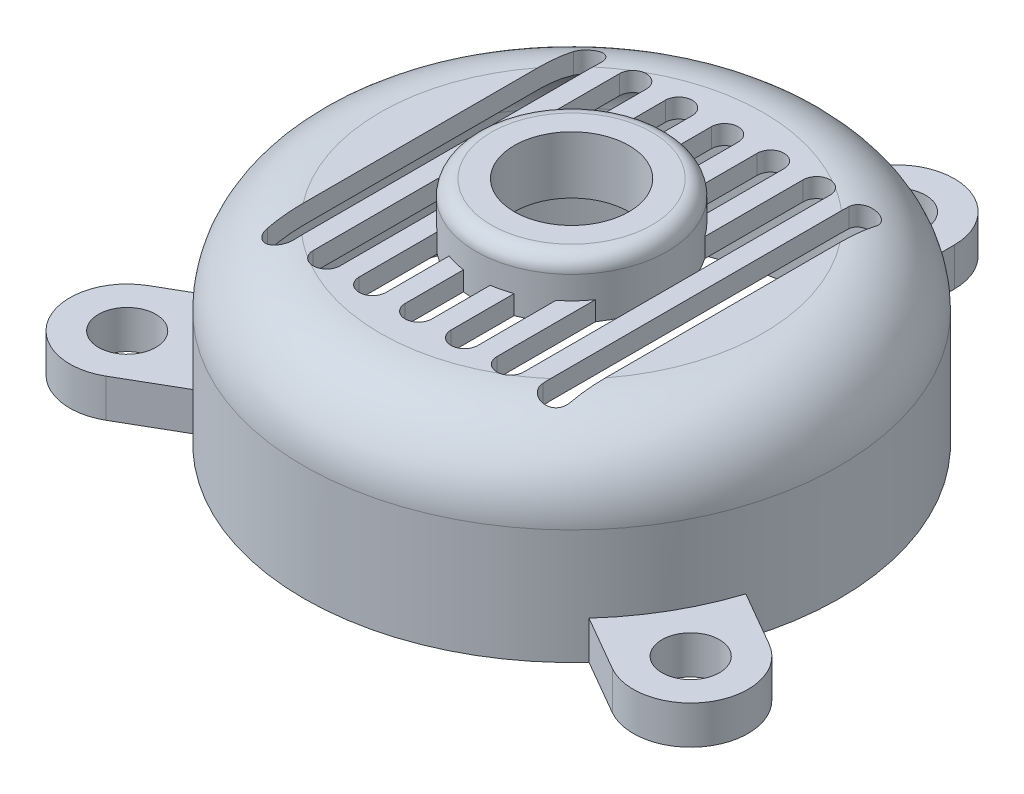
from build123d import *

# Parameters (mm, degrees)
SHELL1_T            = -2.5
SKETCH2_R           = 3.75
BOSS_EXTRUDE1_DEPTH = 5
CIRPATTERN1_COUNT   = 6
CUT_EXTRUDE2_REACH  = 73.33
LPATTERN1_COUNT     = 7
LPATTERN1_PITCH     = 6
SKETCH3_R           = 12.5
BOSS_EXTRUDE2_DEPTH = 7.5
SKETCH4_R           = 7.5
CUT_EXTRUDE1_DEPTH  = 74.23270236
FILLET1_R           = 2


with BuildPart() as part:
    # Sketch1 → Revolve1 (revolve)
    with BuildSketch(Plane.XY, mode=Mode.PRIVATE) as revolve1_sk:
        with BuildLine():
            Line((0, 0), (0, 25))
            Line((0, 25), (25, 25))
            ThreePointArc((25, 25), (32.071067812, 22.071067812), (35, 15))
            Line((35, 15), (35, 0))
            Line((35, 0), (0, 0))
        make_face()
    revolve(revolve1_sk.sketch.rotate(Axis((0, 25, 0), (0, -1, 0)), 180), axis=Axis((0, 25, 0), (0, -1, 0)))

    # Shell1
    shell1_openings = [part.faces().sort_by_distance(p)[0] for p in [
        (0, 0, 0),
    ]]
    offset(amount=SHELL1_T, openings=shell1_openings, kind=Kind.INTERSECTION)

    # Sketch2 → Boss-Extrude1 (add)
    with BuildSketch(Plane(origin=(0, 0, 0), x_dir=(1, 0, 0), z_dir=(0, 1, 0))):
        with BuildLine():
            Line((-7.5, 42.5), (-7.5, 34.186985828))
            ThreePointArc((-7.5, 34.186985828), (0, 35), (7.5, 34.186985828))
            Line((7.5, 34.186985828), (7.5, 42.5))
            ThreePointArc((7.5, 42.5), (0, 50), (-7.5, 42.5))
        make_face()
        with Locations(Location((0, 42.5, 0), (0, 0, 270))):
            Circle(SKETCH2_R, mode=Mode.SUBTRACT)
    boss_extrude1 = extrude(amount=BOSS_EXTRUDE1_DEPTH)

    # CirPattern1: Boss-Extrude1 ×6 about axis, 3 skipped
    cirpattern1_axis = Axis((0, 0, 0), (0, 1, 0))
    add([boss_extrude1.rotate(cirpattern1_axis, i * 360 / CIRPATTERN1_COUNT) for i in range(1, CIRPATTERN1_COUNT) if i not in (1, 3, 5)])

    # Sketch5 → Cut-Extrude2 (cut, up to next)
    with BuildSketch(Plane(origin=(0, 25, 0), x_dir=(1, 0, 0), z_dir=(0, 1, 0)), mode=Mode.PRIVATE) as cut_extrude2_sk1:
        with BuildLine():
            Line((-16.25, 20), (-16.25, -20))
            ThreePointArc((-16.25, -20), (-18, -21.75), (-19.75, -20))
            Line((-19.75, -20), (-19.75, 20))
            ThreePointArc((-19.75, 20), (-18, 21.75), (-16.25, 20))
        make_face()
    cut_extrude2_tool1 = extrude(cut_extrude2_sk1.sketch, amount=-CUT_EXTRUDE2_REACH, mode=Mode.PRIVATE) & part.part
    cut_extrude2 = cut_extrude2_tool1.solids().sort_by_distance((-18, 25, 0))[0]
    add(cut_extrude2, mode=Mode.SUBTRACT)

    # LPattern1: Cut-Extrude2; each copy of Cut-Extrude2 runs up to whatever stops it at its own place
    lpattern1_before = part.part  # the part as the pattern finds it: every copy runs up to it
    lpattern1_cut_extrude2_long = extrude(cut_extrude2_sk1.sketch, amount=-CUT_EXTRUDE2_REACH, mode=Mode.PRIVATE)
    lpattern1_cut_extrude2_tool1 = lpattern1_cut_extrude2_long.moved(Location(Vector(1, 0, 0) * (1 * LPATTERN1_PITCH))) & lpattern1_before
    add(lpattern1_cut_extrude2_tool1.solids().sort_by_distance((-12, 25, 0))[0], mode=Mode.SUBTRACT)
    lpattern1_cut_extrude2_tool2 = lpattern1_cut_extrude2_long.moved(Location(Vector(1, 0, 0) * (2 * LPATTERN1_PITCH))) & lpattern1_before
    add(lpattern1_cut_extrude2_tool2.solids().sort_by_distance((-6, 25, 0))[0], mode=Mode.SUBTRACT)
    lpattern1_cut_extrude2_tool3 = lpattern1_cut_extrude2_long.moved(Location(Vector(1, 0, 0) * (3 * LPATTERN1_PITCH))) & lpattern1_before
    add(lpattern1_cut_extrude2_tool3.solids().sort_by_distance((0, 25, 0))[0], mode=Mode.SUBTRACT)
    lpattern1_cut_extrude2_tool4 = lpattern1_cut_extrude2_long.moved(Location(Vector(1, 0, 0) * (4 * LPATTERN1_PITCH))) & lpattern1_before
    add(lpattern1_cut_extrude2_tool4.solids().sort_by_distance((6, 25, 0))[0], mode=Mode.SUBTRACT)
    lpattern1_cut_extrude2_tool5 = lpattern1_cut_extrude2_long.moved(Location(Vector(1, 0, 0) * (5 * LPATTERN1_PITCH))) & lpattern1_before
    add(lpattern1_cut_extrude2_tool5.solids().sort_by_distance((12, 25, 0))[0], mode=Mode.SUBTRACT)
    lpattern1_cut_extrude2_tool6 = lpattern1_cut_extrude2_long.moved(Location(Vector(1, 0, 0) * (6 * LPATTERN1_PITCH))) & lpattern1_before
    add(lpattern1_cut_extrude2_tool6.solids().sort_by_distance((18, 25, 0))[0], mode=Mode.SUBTRACT)

    # Sketch3 → Boss-Extrude2 (add)
    with BuildSketch(Plane(origin=(0, 22.5, 0), x_dir=(1, 0, 0), z_dir=(0, 1, 0))):
        with Locations(Location((0, 0, 0), (0, 0, 325.084793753))):
            Circle(SKETCH3_R)
    extrude(amount=BOSS_EXTRUDE2_DEPTH)

    # Sketch4 → Cut-Extrude1 (cut, through all)
    with BuildSketch(Plane(origin=(0, 30, 0), x_dir=(1, 0, 0), z_dir=(0, 1, 0))):
        with Locations(Location((0, 0, 0), (0, 0, 270))):
            Circle(SKETCH4_R)
    extrude(amount=-CUT_EXTRUDE1_DEPTH, mode=Mode.SUBTRACT)

    # Fillet1
    fillet1_edges = [part.edges().sort_by_distance(p)[0] for p in [
        (-10.25, 30, -7.154544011),
    ]]
    fillet(fillet1_edges, radius=FILLET1_R)


solid = part.part
